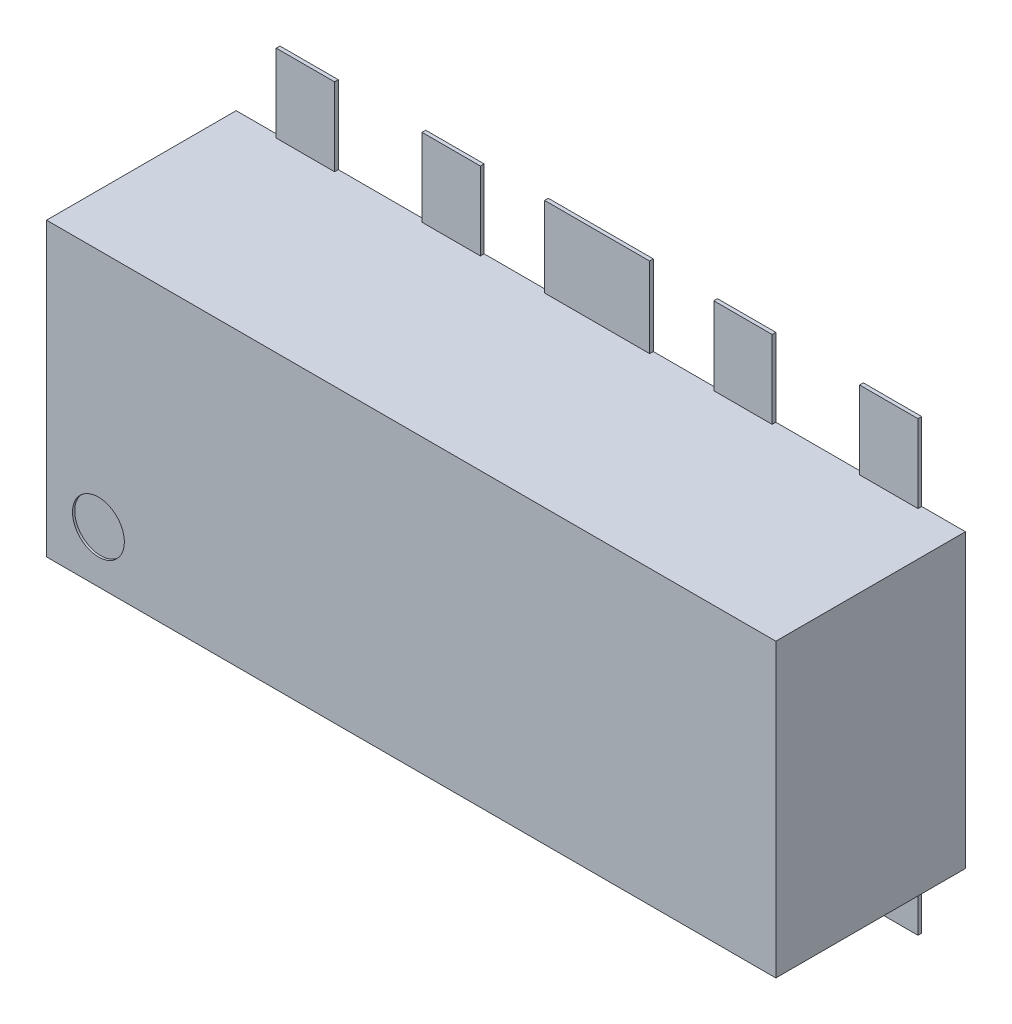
ISO-10303-21;
HEADER;
FILE_DESCRIPTION(('STEP AP214'),'2;1');
FILE_NAME('part.step','',(''),(''),'','','');
FILE_SCHEMA(('AUTOMOTIVE_DESIGN { 1 0 10303 214 1 1 1 1 }'));
ENDSEC;
DATA;
#1=APPLICATION_CONTEXT('core data for automotive mechanical design processes');
#2=APPLICATION_PROTOCOL_DEFINITION('international standard','automotive_design',2000,#1);
#3=PRODUCT_CONTEXT('',#1,'mechanical');
#4=PRODUCT('Part','Part','',(#3));
#5=PRODUCT_RELATED_PRODUCT_CATEGORY('part','',(#4));
#6=PRODUCT_DEFINITION_FORMATION('','',#4);
#7=PRODUCT_DEFINITION_CONTEXT('part definition',#1,'design');
#8=PRODUCT_DEFINITION('design','',#6,#7);
#9=PRODUCT_DEFINITION_SHAPE('','',#8);
#10=(LENGTH_UNIT() NAMED_UNIT(*) SI_UNIT(.MILLI.,.METRE.));
#11=(NAMED_UNIT(*) PLANE_ANGLE_UNIT() SI_UNIT($,.RADIAN.));
#12=(NAMED_UNIT(*) SI_UNIT($,.STERADIAN.) SOLID_ANGLE_UNIT());
#13=UNCERTAINTY_MEASURE_WITH_UNIT(LENGTH_MEASURE(1.E-05),#10,'distance_accuracy_value','');
#14=(GEOMETRIC_REPRESENTATION_CONTEXT(3) GLOBAL_UNCERTAINTY_ASSIGNED_CONTEXT((#13)) GLOBAL_UNIT_ASSIGNED_CONTEXT((#10,
#11,#12)) REPRESENTATION_CONTEXT('',''));
#15=CARTESIAN_POINT('',(0.,0.,0.));
#16=DIRECTION('',(0.,0.,1.));
#17=DIRECTION('',(1.,0.,0.));
#18=AXIS2_PLACEMENT_3D('',#15,#16,#17);
#19=CARTESIAN_POINT('',(0.,0.,0.718566));
#20=DIRECTION('',(0.,0.,1.));
#21=DIRECTION('',(1.,0.,0.));
#22=AXIS2_PLACEMENT_3D('',#19,#20,#21);
#23=PLANE('',#22);
#24=CARTESIAN_POINT('',(-1.07220000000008,-0.322200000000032,0.718566));
#25=DIRECTION('',(0.,0.,1.));
#26=DIRECTION('',(1.,0.,0.));
#27=AXIS2_PLACEMENT_3D('',#24,#25,#26);
#28=CIRCLE('',#27,0.0889);
#29=CARTESIAN_POINT('',(-0.98330000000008,-0.322200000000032,0.718566));
#30=VERTEX_POINT('',#29);
#31=EDGE_CURVE('E19',#30,#30,#28,.T.);
#32=ORIENTED_EDGE('',*,*,#31,.T.);
#33=EDGE_LOOP('',(#32));
#34=FACE_BOUND('',#33,.T.);
#35=ADVANCED_FACE('F16',(#34),#23,.T.);
#36=CARTESIAN_POINT('',(1.25000000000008,0.500000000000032,0.0762));
#37=DIRECTION('',(0.,1.,0.));
#38=DIRECTION('',(0.,0.,1.));
#39=AXIS2_PLACEMENT_3D('',#36,#37,#38);
#40=PLANE('',#39);
#41=DIRECTION('',(0.,0.,1.));
#42=VECTOR('',#41,1.);
#43=CARTESIAN_POINT('',(-0.8999982,0.500000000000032,0.0762));
#44=LINE('',#43,#42);
#45=CARTESIAN_POINT('',(-0.8999982,0.500000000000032,0.0762));
#46=VERTEX_POINT('',#45);
#47=CARTESIAN_POINT('',(-0.8999982,0.500000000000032,0.0889));
#48=VERTEX_POINT('',#47);
#49=EDGE_CURVE('E357',#46,#48,#44,.T.);
#50=ORIENTED_EDGE('',*,*,#49,.T.);
#51=DIRECTION('',(1.,0.,0.));
#52=VECTOR('',#51,1.);
#53=CARTESIAN_POINT('',(0.,0.500000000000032,0.0889));
#54=LINE('',#53,#52);
#55=CARTESIAN_POINT('',(-1.0999978,0.500000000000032,0.0889));
#56=VERTEX_POINT('',#55);
#57=EDGE_CURVE('E300',#56,#48,#54,.T.);
#58=ORIENTED_EDGE('',*,*,#57,.F.);
#59=DIRECTION('',(0.,0.,1.));
#60=VECTOR('',#59,1.);
#61=CARTESIAN_POINT('',(-1.0999978,0.500000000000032,0.0762));
#62=LINE('',#61,#60);
#63=CARTESIAN_POINT('',(-1.0999978,0.500000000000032,0.0762));
#64=VERTEX_POINT('',#63);
#65=EDGE_CURVE('E296',#56,#64,#62,.F.);
#66=ORIENTED_EDGE('',*,*,#65,.T.);
#67=DIRECTION('',(1.,0.,0.));
#68=VECTOR('',#67,1.);
#69=CARTESIAN_POINT('',(1.25000000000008,0.500000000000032,0.0762));
#70=LINE('',#69,#68);
#71=CARTESIAN_POINT('',(-1.25000000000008,0.500000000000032,0.0762));
#72=VERTEX_POINT('',#71);
#73=EDGE_CURVE('E293',#64,#72,#70,.F.);
#74=ORIENTED_EDGE('',*,*,#73,.T.);
#75=DIRECTION('',(0.,0.,1.));
#76=VECTOR('',#75,1.);
#77=CARTESIAN_POINT('',(-1.25000000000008,0.500000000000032,0.0762));
#78=LINE('',#77,#76);
#79=CARTESIAN_POINT('',(-1.25000000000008,0.500000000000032,0.726186));
#80=VERTEX_POINT('',#79);
#81=EDGE_CURVE('E320',#72,#80,#78,.T.);
#82=ORIENTED_EDGE('',*,*,#81,.T.);
#83=DIRECTION('',(1.,0.,0.));
#84=VECTOR('',#83,1.);
#85=CARTESIAN_POINT('',(0.,0.500000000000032,0.726186));
#86=LINE('',#85,#84);
#87=CARTESIAN_POINT('',(1.25000000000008,0.500000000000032,0.726186));
#88=VERTEX_POINT('',#87);
#89=EDGE_CURVE('E328',#88,#80,#86,.F.);
#90=ORIENTED_EDGE('',*,*,#89,.F.);
#91=DIRECTION('',(0.,0.,1.));
#92=VECTOR('',#91,1.);
#93=CARTESIAN_POINT('',(1.25000000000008,0.500000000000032,0.0762));
#94=LINE('',#93,#92);
#95=CARTESIAN_POINT('',(1.25000000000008,0.500000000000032,0.0762));
#96=VERTEX_POINT('',#95);
#97=EDGE_CURVE('E322',#88,#96,#94,.F.);
#98=ORIENTED_EDGE('',*,*,#97,.T.);
#99=DIRECTION('',(1.,0.,0.));
#100=VECTOR('',#99,1.);
#101=CARTESIAN_POINT('',(1.25000000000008,0.500000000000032,0.0762));
#102=LINE('',#101,#100);
#103=CARTESIAN_POINT('',(1.0999978,0.500000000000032,0.0762));
#104=VERTEX_POINT('',#103);
#105=EDGE_CURVE('E383',#96,#104,#102,.F.);
#106=ORIENTED_EDGE('',*,*,#105,.T.);
#107=DIRECTION('',(0.,0.,1.));
#108=VECTOR('',#107,1.);
#109=CARTESIAN_POINT('',(1.0999978,0.500000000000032,0.0762));
#110=LINE('',#109,#108);
#111=CARTESIAN_POINT('',(1.0999978,0.500000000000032,0.0889));
#112=VERTEX_POINT('',#111);
#113=EDGE_CURVE('E381',#104,#112,#110,.T.);
#114=ORIENTED_EDGE('',*,*,#113,.T.);
#115=DIRECTION('',(1.,0.,0.));
#116=VECTOR('',#115,1.);
#117=CARTESIAN_POINT('',(0.,0.500000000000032,0.0889));
#118=LINE('',#117,#116);
#119=CARTESIAN_POINT('',(0.8999982,0.500000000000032,0.0889));
#120=VERTEX_POINT('',#119);
#121=EDGE_CURVE('E354',#120,#112,#118,.T.);
#122=ORIENTED_EDGE('',*,*,#121,.F.);
#123=DIRECTION('',(0.,0.,1.));
#124=VECTOR('',#123,1.);
#125=CARTESIAN_POINT('',(0.8999982,0.500000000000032,0.0762));
#126=LINE('',#125,#124);
#127=CARTESIAN_POINT('',(0.8999982,0.500000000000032,0.0762));
#128=VERTEX_POINT('',#127);
#129=EDGE_CURVE('E379',#120,#128,#126,.F.);
#130=ORIENTED_EDGE('',*,*,#129,.T.);
#131=DIRECTION('',(1.,0.,0.));
#132=VECTOR('',#131,1.);
#133=CARTESIAN_POINT('',(1.25000000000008,0.500000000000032,0.0762));
#134=LINE('',#133,#132);
#135=CARTESIAN_POINT('',(0.5999988,0.500000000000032,0.0762));
#136=VERTEX_POINT('',#135);
#137=EDGE_CURVE('E377',#128,#136,#134,.F.);
#138=ORIENTED_EDGE('',*,*,#137,.T.);
#139=DIRECTION('',(0.,0.,1.));
#140=VECTOR('',#139,1.);
#141=CARTESIAN_POINT('',(0.5999988,0.500000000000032,0.0762));
#142=LINE('',#141,#140);
#143=CARTESIAN_POINT('',(0.5999988,0.500000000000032,0.0889));
#144=VERTEX_POINT('',#143);
#145=EDGE_CURVE('E375',#136,#144,#142,.T.);
#146=ORIENTED_EDGE('',*,*,#145,.T.);
#147=DIRECTION('',(1.,0.,0.));
#148=VECTOR('',#147,1.);
#149=CARTESIAN_POINT('',(0.,0.500000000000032,0.0889));
#150=LINE('',#149,#148);
#151=CARTESIAN_POINT('',(0.3999992,0.500000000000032,0.0889));
#152=VERTEX_POINT('',#151);
#153=EDGE_CURVE('E351',#152,#144,#150,.T.);
#154=ORIENTED_EDGE('',*,*,#153,.F.);
#155=DIRECTION('',(0.,0.,1.));
#156=VECTOR('',#155,1.);
#157=CARTESIAN_POINT('',(0.3999992,0.500000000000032,0.0762));
#158=LINE('',#157,#156);
#159=CARTESIAN_POINT('',(0.3999992,0.500000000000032,0.0762));
#160=VERTEX_POINT('',#159);
#161=EDGE_CURVE('E373',#152,#160,#158,.F.);
#162=ORIENTED_EDGE('',*,*,#161,.T.);
#163=DIRECTION('',(1.,0.,0.));
#164=VECTOR('',#163,1.);
#165=CARTESIAN_POINT('',(1.25000000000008,0.500000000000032,0.0762));
#166=LINE('',#165,#164);
#167=CARTESIAN_POINT('',(0.1800098,0.500000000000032,0.0762));
#168=VERTEX_POINT('',#167);
#169=EDGE_CURVE('E371',#160,#168,#166,.F.);
#170=ORIENTED_EDGE('',*,*,#169,.T.);
#171=DIRECTION('',(0.,0.,1.));
#172=VECTOR('',#171,1.);
#173=CARTESIAN_POINT('',(0.1800098,0.500000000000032,0.0762));
#174=LINE('',#173,#172);
#175=CARTESIAN_POINT('',(0.1800098,0.500000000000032,0.0889));
#176=VERTEX_POINT('',#175);
#177=EDGE_CURVE('E369',#168,#176,#174,.T.);
#178=ORIENTED_EDGE('',*,*,#177,.T.);
#179=DIRECTION('',(1.,0.,0.));
#180=VECTOR('',#179,1.);
#181=CARTESIAN_POINT('',(0.,0.500000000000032,0.0889));
#182=LINE('',#181,#180);
#183=CARTESIAN_POINT('',(-0.1800098,0.500000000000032,0.0889));
#184=VERTEX_POINT('',#183);
#185=EDGE_CURVE('E348',#184,#176,#182,.T.);
#186=ORIENTED_EDGE('',*,*,#185,.F.);
#187=DIRECTION('',(0.,0.,1.));
#188=VECTOR('',#187,1.);
#189=CARTESIAN_POINT('',(-0.1800098,0.500000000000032,0.0762));
#190=LINE('',#189,#188);
#191=CARTESIAN_POINT('',(-0.1800098,0.500000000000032,0.0762));
#192=VERTEX_POINT('',#191);
#193=EDGE_CURVE('E367',#184,#192,#190,.F.);
#194=ORIENTED_EDGE('',*,*,#193,.T.);
#195=DIRECTION('',(1.,0.,0.));
#196=VECTOR('',#195,1.);
#197=CARTESIAN_POINT('',(1.25000000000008,0.500000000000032,0.0762));
#198=LINE('',#197,#196);
#199=CARTESIAN_POINT('',(-0.3999992,0.500000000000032,0.0762));
#200=VERTEX_POINT('',#199);
#201=EDGE_CURVE('E365',#192,#200,#198,.F.);
#202=ORIENTED_EDGE('',*,*,#201,.T.);
#203=DIRECTION('',(0.,0.,1.));
#204=VECTOR('',#203,1.);
#205=CARTESIAN_POINT('',(-0.3999992,0.500000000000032,0.0762));
#206=LINE('',#205,#204);
#207=CARTESIAN_POINT('',(-0.3999992,0.500000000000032,0.0889));
#208=VERTEX_POINT('',#207);
#209=EDGE_CURVE('E363',#200,#208,#206,.T.);
#210=ORIENTED_EDGE('',*,*,#209,.T.);
#211=DIRECTION('',(1.,0.,0.));
#212=VECTOR('',#211,1.);
#213=CARTESIAN_POINT('',(0.,0.500000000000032,0.0889));
#214=LINE('',#213,#212);
#215=CARTESIAN_POINT('',(-0.5999988,0.500000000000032,0.0889));
#216=VERTEX_POINT('',#215);
#217=EDGE_CURVE('E345',#216,#208,#214,.T.);
#218=ORIENTED_EDGE('',*,*,#217,.F.);
#219=DIRECTION('',(0.,0.,1.));
#220=VECTOR('',#219,1.);
#221=CARTESIAN_POINT('',(-0.5999988,0.500000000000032,0.0762));
#222=LINE('',#221,#220);
#223=CARTESIAN_POINT('',(-0.5999988,0.500000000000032,0.0762));
#224=VERTEX_POINT('',#223);
#225=EDGE_CURVE('E361',#216,#224,#222,.F.);
#226=ORIENTED_EDGE('',*,*,#225,.T.);
#227=DIRECTION('',(1.,0.,0.));
#228=VECTOR('',#227,1.);
#229=CARTESIAN_POINT('',(1.25000000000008,0.500000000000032,0.0762));
#230=LINE('',#229,#228);
#231=EDGE_CURVE('E359',#224,#46,#230,.F.);
#232=ORIENTED_EDGE('',*,*,#231,.T.);
#233=EDGE_LOOP('',(#50,#58,#66,#74,#82,#90,#98,#106,#114,#122,#130,#138,#146,#154,#162,#170,
#178,#186,#194,#202,#210,#218,#226,#232));
#234=FACE_BOUND('',#233,.T.);
#235=ADVANCED_FACE('F298',(#234),#40,.T.);
#236=CARTESIAN_POINT('',(-1.07220000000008,-0.322200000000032,0.726186));
#237=DIRECTION('',(0.,0.,1.));
#238=DIRECTION('',(1.,0.,0.));
#239=AXIS2_PLACEMENT_3D('',#236,#237,#238);
#240=CYLINDRICAL_SURFACE('',#239,0.0889);
#241=ORIENTED_EDGE('',*,*,#31,.F.);
#242=EDGE_LOOP('',(#241));
#243=FACE_BOUND('',#242,.T.);
#244=CARTESIAN_POINT('',(-1.07220000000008,-0.322200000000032,0.726186));
#245=DIRECTION('',(0.,0.,1.));
#246=DIRECTION('',(1.,0.,0.));
#247=AXIS2_PLACEMENT_3D('',#244,#245,#246);
#248=CIRCLE('',#247,0.0889);
#249=CARTESIAN_POINT('',(-0.98330000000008,-0.322200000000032,0.726186));
#250=VERTEX_POINT('',#249);
#251=EDGE_CURVE('E325',#250,#250,#248,.F.);
#252=ORIENTED_EDGE('',*,*,#251,.F.);
#253=EDGE_LOOP('',(#252));
#254=FACE_BOUND('',#253,.T.);
#255=ADVANCED_FACE('F892',(#243,#254),#240,.F.);
#256=CARTESIAN_POINT('',(0.,0.,0.0889));
#257=DIRECTION('',(0.,0.,1.));
#258=DIRECTION('',(1.,0.,0.));
#259=AXIS2_PLACEMENT_3D('',#256,#257,#258);
#260=PLANE('',#259);
#261=DIRECTION('',(0.,1.,0.));
#262=VECTOR('',#261,1.);
#263=CARTESIAN_POINT('',(0.8999982,0.7670038,0.0889));
#264=LINE('',#263,#262);
#265=CARTESIAN_POINT('',(0.8999982,0.7670038,0.0889));
#266=VERTEX_POINT('',#265);
#267=EDGE_CURVE('E406',#120,#266,#264,.T.);
#268=ORIENTED_EDGE('',*,*,#267,.F.);
#269=ORIENTED_EDGE('',*,*,#121,.T.);
#270=DIRECTION('',(0.,1.,0.));
#271=VECTOR('',#270,1.);
#272=CARTESIAN_POINT('',(1.0999978,0.1070102,0.0889));
#273=LINE('',#272,#271);
#274=CARTESIAN_POINT('',(1.0999978,0.7670038,0.0889));
#275=VERTEX_POINT('',#274);
#276=EDGE_CURVE('E327',#275,#112,#273,.F.);
#277=ORIENTED_EDGE('',*,*,#276,.F.);
#278=DIRECTION('',(1.,0.,0.));
#279=VECTOR('',#278,1.);
#280=CARTESIAN_POINT('',(1.0999978,0.7670038,0.0889));
#281=LINE('',#280,#279);
#282=EDGE_CURVE('E332',#266,#275,#281,.T.);
#283=ORIENTED_EDGE('',*,*,#282,.F.);
#284=EDGE_LOOP('',(#268,#269,#277,#283));
#285=FACE_BOUND('',#284,.T.);
#286=ADVANCED_FACE('F404',(#285),#260,.T.);
#287=CARTESIAN_POINT('',(0.,0.,0.0889));
#288=DIRECTION('',(0.,0.,1.));
#289=DIRECTION('',(1.,0.,0.));
#290=AXIS2_PLACEMENT_3D('',#287,#288,#289);
#291=PLANE('',#290);
#292=DIRECTION('',(0.,1.,0.));
#293=VECTOR('',#292,1.);
#294=CARTESIAN_POINT('',(0.3999992,0.7670038,0.0889));
#295=LINE('',#294,#293);
#296=CARTESIAN_POINT('',(0.3999992,0.7670038,0.0889));
#297=VERTEX_POINT('',#296);
#298=EDGE_CURVE('E558',#152,#297,#295,.T.);
#299=ORIENTED_EDGE('',*,*,#298,.F.);
#300=ORIENTED_EDGE('',*,*,#153,.T.);
#301=DIRECTION('',(0.,1.,0.));
#302=VECTOR('',#301,1.);
#303=CARTESIAN_POINT('',(0.5999988,0.1070102,0.0889));
#304=LINE('',#303,#302);
#305=CARTESIAN_POINT('',(0.5999988,0.7670038,0.0889));
#306=VERTEX_POINT('',#305);
#307=EDGE_CURVE('E412',#306,#144,#304,.F.);
#308=ORIENTED_EDGE('',*,*,#307,.F.);
#309=DIRECTION('',(1.,0.,0.));
#310=VECTOR('',#309,1.);
#311=CARTESIAN_POINT('',(0.5999988,0.7670038,0.0889));
#312=LINE('',#311,#310);
#313=EDGE_CURVE('E562',#297,#306,#312,.T.);
#314=ORIENTED_EDGE('',*,*,#313,.F.);
#315=EDGE_LOOP('',(#299,#300,#308,#314));
#316=FACE_BOUND('',#315,.T.);
#317=ADVANCED_FACE('F572',(#316),#291,.T.);
#318=CARTESIAN_POINT('',(0.,0.,0.0889));
#319=DIRECTION('',(0.,0.,1.));
#320=DIRECTION('',(1.,0.,0.));
#321=AXIS2_PLACEMENT_3D('',#318,#319,#320);
#322=PLANE('',#321);
#323=DIRECTION('',(0.,1.,0.));
#324=VECTOR('',#323,1.);
#325=CARTESIAN_POINT('',(-0.1800098,0.7750048,0.0889));
#326=LINE('',#325,#324);
#327=CARTESIAN_POINT('',(-0.1800098,0.7750048,0.0889));
#328=VERTEX_POINT('',#327);
#329=EDGE_CURVE('E547',#184,#328,#326,.T.);
#330=ORIENTED_EDGE('',*,*,#329,.F.);
#331=ORIENTED_EDGE('',*,*,#185,.T.);
#332=DIRECTION('',(0.,1.,0.));
#333=VECTOR('',#332,1.);
#334=CARTESIAN_POINT('',(0.1800098,-0.7750048,0.0889));
#335=LINE('',#334,#333);
#336=CARTESIAN_POINT('',(0.1800098,0.7750048,0.0889));
#337=VERTEX_POINT('',#336);
#338=EDGE_CURVE('E553',#337,#176,#335,.F.);
#339=ORIENTED_EDGE('',*,*,#338,.F.);
#340=DIRECTION('',(1.,0.,0.));
#341=VECTOR('',#340,1.);
#342=CARTESIAN_POINT('',(0.1800098,0.7750048,0.0889));
#343=LINE('',#342,#341);
#344=EDGE_CURVE('E551',#328,#337,#343,.T.);
#345=ORIENTED_EDGE('',*,*,#344,.F.);
#346=EDGE_LOOP('',(#330,#331,#339,#345));
#347=FACE_BOUND('',#346,.T.);
#348=ADVANCED_FACE('F883',(#347),#322,.T.);
#349=CARTESIAN_POINT('',(0.,0.,0.0889));
#350=DIRECTION('',(0.,0.,1.));
#351=DIRECTION('',(1.,0.,0.));
#352=AXIS2_PLACEMENT_3D('',#349,#350,#351);
#353=PLANE('',#352);
#354=DIRECTION('',(0.,1.,0.));
#355=VECTOR('',#354,1.);
#356=CARTESIAN_POINT('',(-0.5999988,0.7670038,0.0889));
#357=LINE('',#356,#355);
#358=CARTESIAN_POINT('',(-0.5999988,0.7670038,0.0889));
#359=VERTEX_POINT('',#358);
#360=EDGE_CURVE('E536',#216,#359,#357,.T.);
#361=ORIENTED_EDGE('',*,*,#360,.F.);
#362=ORIENTED_EDGE('',*,*,#217,.T.);
#363=DIRECTION('',(0.,1.,0.));
#364=VECTOR('',#363,1.);
#365=CARTESIAN_POINT('',(-0.3999992,0.1070102,0.0889));
#366=LINE('',#365,#364);
#367=CARTESIAN_POINT('',(-0.3999992,0.7670038,0.0889));
#368=VERTEX_POINT('',#367);
#369=EDGE_CURVE('E542',#368,#208,#366,.F.);
#370=ORIENTED_EDGE('',*,*,#369,.F.);
#371=DIRECTION('',(1.,0.,0.));
#372=VECTOR('',#371,1.);
#373=CARTESIAN_POINT('',(-0.3999992,0.7670038,0.0889));
#374=LINE('',#373,#372);
#375=EDGE_CURVE('E540',#359,#368,#374,.T.);
#376=ORIENTED_EDGE('',*,*,#375,.F.);
#377=EDGE_LOOP('',(#361,#362,#370,#376));
#378=FACE_BOUND('',#377,.T.);
#379=ADVANCED_FACE('F879',(#378),#353,.T.);
#380=CARTESIAN_POINT('',(0.,0.,0.0889));
#381=DIRECTION('',(0.,0.,1.));
#382=DIRECTION('',(1.,0.,0.));
#383=AXIS2_PLACEMENT_3D('',#380,#381,#382);
#384=PLANE('',#383);
#385=DIRECTION('',(0.,1.,0.));
#386=VECTOR('',#385,1.);
#387=CARTESIAN_POINT('',(-1.0999978,0.7670038,0.0889));
#388=LINE('',#387,#386);
#389=CARTESIAN_POINT('',(-1.0999978,0.7670038,0.0889));
#390=VERTEX_POINT('',#389);
#391=EDGE_CURVE('E525',#56,#390,#388,.T.);
#392=ORIENTED_EDGE('',*,*,#391,.F.);
#393=ORIENTED_EDGE('',*,*,#57,.T.);
#394=DIRECTION('',(0.,1.,0.));
#395=VECTOR('',#394,1.);
#396=CARTESIAN_POINT('',(-0.8999982,0.1070102,0.0889));
#397=LINE('',#396,#395);
#398=CARTESIAN_POINT('',(-0.8999982,0.7670038,0.0889));
#399=VERTEX_POINT('',#398);
#400=EDGE_CURVE('E531',#399,#48,#397,.F.);
#401=ORIENTED_EDGE('',*,*,#400,.F.);
#402=DIRECTION('',(1.,0.,0.));
#403=VECTOR('',#402,1.);
#404=CARTESIAN_POINT('',(-0.8999982,0.7670038,0.0889));
#405=LINE('',#404,#403);
#406=EDGE_CURVE('E529',#390,#399,#405,.T.);
#407=ORIENTED_EDGE('',*,*,#406,.F.);
#408=EDGE_LOOP('',(#392,#393,#401,#407));
#409=FACE_BOUND('',#408,.T.);
#410=ADVANCED_FACE('F874',(#409),#384,.T.);
#411=CARTESIAN_POINT('',(0.,0.,0.0889));
#412=DIRECTION('',(0.,0.,1.));
#413=DIRECTION('',(1.,0.,0.));
#414=AXIS2_PLACEMENT_3D('',#411,#412,#413);
#415=PLANE('',#414);
#416=DIRECTION('',(0.,1.,0.));
#417=VECTOR('',#416,1.);
#418=CARTESIAN_POINT('',(-0.3999992,-0.7670038,0.0889));
#419=LINE('',#418,#417);
#420=CARTESIAN_POINT('',(-0.3999992,-0.500000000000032,0.0889));
#421=VERTEX_POINT('',#420);
#422=CARTESIAN_POINT('',(-0.3999992,-0.7670038,0.0889));
#423=VERTEX_POINT('',#422);
#424=EDGE_CURVE('E504',#421,#423,#419,.F.);
#425=ORIENTED_EDGE('',*,*,#424,.F.);
#426=DIRECTION('',(1.,0.,0.));
#427=VECTOR('',#426,1.);
#428=CARTESIAN_POINT('',(-1.25000000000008,-0.500000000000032,0.0889));
#429=LINE('',#428,#427);
#430=CARTESIAN_POINT('',(-0.5999988,-0.500000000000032,0.0889));
#431=VERTEX_POINT('',#430);
#432=EDGE_CURVE('E465',#431,#421,#429,.T.);
#433=ORIENTED_EDGE('',*,*,#432,.F.);
#434=DIRECTION('',(0.,1.,0.));
#435=VECTOR('',#434,1.);
#436=CARTESIAN_POINT('',(-0.5999988,-0.1070102,0.0889));
#437=LINE('',#436,#435);
#438=CARTESIAN_POINT('',(-0.5999988,-0.7670038,0.0889));
#439=VERTEX_POINT('',#438);
#440=EDGE_CURVE('E510',#439,#431,#437,.T.);
#441=ORIENTED_EDGE('',*,*,#440,.F.);
#442=DIRECTION('',(1.,0.,0.));
#443=VECTOR('',#442,1.);
#444=CARTESIAN_POINT('',(-0.5999988,-0.7670038,0.0889));
#445=LINE('',#444,#443);
#446=EDGE_CURVE('E508',#423,#439,#445,.F.);
#447=ORIENTED_EDGE('',*,*,#446,.F.);
#448=EDGE_LOOP('',(#425,#433,#441,#447));
#449=FACE_BOUND('',#448,.T.);
#450=ADVANCED_FACE('F840',(#449),#415,.T.);
#451=CARTESIAN_POINT('',(0.,0.,0.0889));
#452=DIRECTION('',(0.,0.,1.));
#453=DIRECTION('',(1.,0.,0.));
#454=AXIS2_PLACEMENT_3D('',#451,#452,#453);
#455=PLANE('',#454);
#456=DIRECTION('',(0.,1.,0.));
#457=VECTOR('',#456,1.);
#458=CARTESIAN_POINT('',(0.1800098,-0.7750048,0.0889));
#459=LINE('',#458,#457);
#460=CARTESIAN_POINT('',(0.1800098,-0.500000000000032,0.0889));
#461=VERTEX_POINT('',#460);
#462=CARTESIAN_POINT('',(0.1800098,-0.7750048,0.0889));
#463=VERTEX_POINT('',#462);
#464=EDGE_CURVE('E494',#461,#463,#459,.F.);
#465=ORIENTED_EDGE('',*,*,#464,.F.);
#466=DIRECTION('',(1.,0.,0.));
#467=VECTOR('',#466,1.);
#468=CARTESIAN_POINT('',(-1.25000000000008,-0.500000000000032,0.0889));
#469=LINE('',#468,#467);
#470=CARTESIAN_POINT('',(-0.1800098,-0.500000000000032,0.0889));
#471=VERTEX_POINT('',#470);
#472=EDGE_CURVE('E458',#471,#461,#469,.T.);
#473=ORIENTED_EDGE('',*,*,#472,.F.);
#474=DIRECTION('',(0.,1.,0.));
#475=VECTOR('',#474,1.);
#476=CARTESIAN_POINT('',(-0.1800098,0.7750048,0.0889));
#477=LINE('',#476,#475);
#478=CARTESIAN_POINT('',(-0.1800098,-0.7750048,0.0889));
#479=VERTEX_POINT('',#478);
#480=EDGE_CURVE('E500',#479,#471,#477,.T.);
#481=ORIENTED_EDGE('',*,*,#480,.F.);
#482=DIRECTION('',(1.,0.,0.));
#483=VECTOR('',#482,1.);
#484=CARTESIAN_POINT('',(-0.1800098,-0.7750048,0.0889));
#485=LINE('',#484,#483);
#486=EDGE_CURVE('E498',#463,#479,#485,.F.);
#487=ORIENTED_EDGE('',*,*,#486,.F.);
#488=EDGE_LOOP('',(#465,#473,#481,#487));
#489=FACE_BOUND('',#488,.T.);
#490=ADVANCED_FACE('F699',(#489),#455,.T.);
#491=CARTESIAN_POINT('',(0.,0.,0.0889));
#492=DIRECTION('',(0.,0.,1.));
#493=DIRECTION('',(1.,0.,0.));
#494=AXIS2_PLACEMENT_3D('',#491,#492,#493);
#495=PLANE('',#494);
#496=DIRECTION('',(0.,1.,0.));
#497=VECTOR('',#496,1.);
#498=CARTESIAN_POINT('',(0.5999988,-0.7670038,0.0889));
#499=LINE('',#498,#497);
#500=CARTESIAN_POINT('',(0.5999988,-0.500000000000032,0.0889));
#501=VERTEX_POINT('',#500);
#502=CARTESIAN_POINT('',(0.5999988,-0.7670038,0.0889));
#503=VERTEX_POINT('',#502);
#504=EDGE_CURVE('E484',#501,#503,#499,.F.);
#505=ORIENTED_EDGE('',*,*,#504,.F.);
#506=DIRECTION('',(1.,0.,0.));
#507=VECTOR('',#506,1.);
#508=CARTESIAN_POINT('',(-1.25000000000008,-0.500000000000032,0.0889));
#509=LINE('',#508,#507);
#510=CARTESIAN_POINT('',(0.3999992,-0.500000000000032,0.0889));
#511=VERTEX_POINT('',#510);
#512=EDGE_CURVE('E451',#511,#501,#509,.T.);
#513=ORIENTED_EDGE('',*,*,#512,.F.);
#514=DIRECTION('',(0.,1.,0.));
#515=VECTOR('',#514,1.);
#516=CARTESIAN_POINT('',(0.3999992,-0.1070102,0.0889));
#517=LINE('',#516,#515);
#518=CARTESIAN_POINT('',(0.3999992,-0.7670038,0.0889));
#519=VERTEX_POINT('',#518);
#520=EDGE_CURVE('E490',#519,#511,#517,.T.);
#521=ORIENTED_EDGE('',*,*,#520,.F.);
#522=DIRECTION('',(1.,0.,0.));
#523=VECTOR('',#522,1.);
#524=CARTESIAN_POINT('',(0.3999992,-0.7670038,0.0889));
#525=LINE('',#524,#523);
#526=EDGE_CURVE('E488',#503,#519,#525,.F.);
#527=ORIENTED_EDGE('',*,*,#526,.F.);
#528=EDGE_LOOP('',(#505,#513,#521,#527));
#529=FACE_BOUND('',#528,.T.);
#530=ADVANCED_FACE('F690',(#529),#495,.T.);
#531=CARTESIAN_POINT('',(0.,0.,0.0889));
#532=DIRECTION('',(0.,0.,1.));
#533=DIRECTION('',(1.,0.,0.));
#534=AXIS2_PLACEMENT_3D('',#531,#532,#533);
#535=PLANE('',#534);
#536=DIRECTION('',(0.,1.,0.));
#537=VECTOR('',#536,1.);
#538=CARTESIAN_POINT('',(1.0999978,-0.7670038,0.0889));
#539=LINE('',#538,#537);
#540=CARTESIAN_POINT('',(1.0999978,-0.500000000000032,0.0889));
#541=VERTEX_POINT('',#540);
#542=CARTESIAN_POINT('',(1.0999978,-0.7670038,0.0889));
#543=VERTEX_POINT('',#542);
#544=EDGE_CURVE('E474',#541,#543,#539,.F.);
#545=ORIENTED_EDGE('',*,*,#544,.F.);
#546=DIRECTION('',(1.,0.,0.));
#547=VECTOR('',#546,1.);
#548=CARTESIAN_POINT('',(-1.25000000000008,-0.500000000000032,0.0889));
#549=LINE('',#548,#547);
#550=CARTESIAN_POINT('',(0.8999982,-0.500000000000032,0.0889));
#551=VERTEX_POINT('',#550);
#552=EDGE_CURVE('E444',#551,#541,#549,.T.);
#553=ORIENTED_EDGE('',*,*,#552,.F.);
#554=DIRECTION('',(0.,1.,0.));
#555=VECTOR('',#554,1.);
#556=CARTESIAN_POINT('',(0.8999982,-0.1070102,0.0889));
#557=LINE('',#556,#555);
#558=CARTESIAN_POINT('',(0.8999982,-0.7670038,0.0889));
#559=VERTEX_POINT('',#558);
#560=EDGE_CURVE('E480',#559,#551,#557,.T.);
#561=ORIENTED_EDGE('',*,*,#560,.F.);
#562=DIRECTION('',(1.,0.,0.));
#563=VECTOR('',#562,1.);
#564=CARTESIAN_POINT('',(0.8999982,-0.7670038,0.0889));
#565=LINE('',#564,#563);
#566=EDGE_CURVE('E478',#543,#559,#565,.F.);
#567=ORIENTED_EDGE('',*,*,#566,.F.);
#568=EDGE_LOOP('',(#545,#553,#561,#567));
#569=FACE_BOUND('',#568,.T.);
#570=ADVANCED_FACE('F687',(#569),#535,.T.);
#571=CARTESIAN_POINT('',(0.,0.,0.726186));
#572=DIRECTION('',(0.,0.,1.));
#573=DIRECTION('',(1.,0.,0.));
#574=AXIS2_PLACEMENT_3D('',#571,#572,#573);
#575=PLANE('',#574);
#576=ORIENTED_EDGE('',*,*,#251,.T.);
#577=EDGE_LOOP('',(#576));
#578=FACE_BOUND('',#577,.T.);
#579=ORIENTED_EDGE('',*,*,#89,.T.);
#580=DIRECTION('',(0.,1.,0.));
#581=VECTOR('',#580,1.);
#582=CARTESIAN_POINT('',(-1.25000000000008,0.500000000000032,0.726186));
#583=LINE('',#582,#581);
#584=CARTESIAN_POINT('',(-1.25000000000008,-0.500000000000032,0.726186));
#585=VERTEX_POINT('',#584);
#586=EDGE_CURVE('E522',#585,#80,#583,.T.);
#587=ORIENTED_EDGE('',*,*,#586,.F.);
#588=DIRECTION('',(1.,0.,0.));
#589=VECTOR('',#588,1.);
#590=CARTESIAN_POINT('',(-1.25000000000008,-0.500000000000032,0.726186));
#591=LINE('',#590,#589);
#592=CARTESIAN_POINT('',(1.25000000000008,-0.500000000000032,0.726186));
#593=VERTEX_POINT('',#592);
#594=EDGE_CURVE('E440',#593,#585,#591,.F.);
#595=ORIENTED_EDGE('',*,*,#594,.F.);
#596=DIRECTION('',(0.,1.,0.));
#597=VECTOR('',#596,1.);
#598=CARTESIAN_POINT('',(1.25000000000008,0.,0.726186));
#599=LINE('',#598,#597);
#600=EDGE_CURVE('E335',#593,#88,#599,.T.);
#601=ORIENTED_EDGE('',*,*,#600,.T.);
#602=EDGE_LOOP('',(#579,#587,#595,#601));
#603=FACE_BOUND('',#602,.T.);
#604=ADVANCED_FACE('F689',(#578,#603),#575,.T.);
#605=CARTESIAN_POINT('',(0.,0.,0.0889));
#606=DIRECTION('',(0.,0.,1.));
#607=DIRECTION('',(1.,0.,0.));
#608=AXIS2_PLACEMENT_3D('',#605,#606,#607);
#609=PLANE('',#608);
#610=DIRECTION('',(0.,1.,0.));
#611=VECTOR('',#610,1.);
#612=CARTESIAN_POINT('',(-0.8999982,-0.7670038,0.0889));
#613=LINE('',#612,#611);
#614=CARTESIAN_POINT('',(-0.8999982,-0.500000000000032,0.0889));
#615=VERTEX_POINT('',#614);
#616=CARTESIAN_POINT('',(-0.8999982,-0.7670038,0.0889));
#617=VERTEX_POINT('',#616);
#618=EDGE_CURVE('E514',#615,#617,#613,.F.);
#619=ORIENTED_EDGE('',*,*,#618,.F.);
#620=DIRECTION('',(1.,0.,0.));
#621=VECTOR('',#620,1.);
#622=CARTESIAN_POINT('',(-1.25000000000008,-0.500000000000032,0.0889));
#623=LINE('',#622,#621);
#624=CARTESIAN_POINT('',(-1.0999978,-0.500000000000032,0.0889));
#625=VERTEX_POINT('',#624);
#626=EDGE_CURVE('E432',#625,#615,#623,.T.);
#627=ORIENTED_EDGE('',*,*,#626,.F.);
#628=DIRECTION('',(0.,1.,0.));
#629=VECTOR('',#628,1.);
#630=CARTESIAN_POINT('',(-1.0999978,-0.1070102,0.0889));
#631=LINE('',#630,#629);
#632=CARTESIAN_POINT('',(-1.0999978,-0.7670038,0.0889));
#633=VERTEX_POINT('',#632);
#634=EDGE_CURVE('E520',#633,#625,#631,.T.);
#635=ORIENTED_EDGE('',*,*,#634,.F.);
#636=DIRECTION('',(1.,0.,0.));
#637=VECTOR('',#636,1.);
#638=CARTESIAN_POINT('',(-1.0999978,-0.7670038,0.0889));
#639=LINE('',#638,#637);
#640=EDGE_CURVE('E518',#617,#633,#639,.F.);
#641=ORIENTED_EDGE('',*,*,#640,.F.);
#642=EDGE_LOOP('',(#619,#627,#635,#641));
#643=FACE_BOUND('',#642,.T.);
#644=ADVANCED_FACE('F697',(#643),#609,.T.);
#645=CARTESIAN_POINT('',(1.0999978,0.1070102,0.0762));
#646=DIRECTION('',(1.,0.,0.));
#647=DIRECTION('',(0.,0.,-1.));
#648=AXIS2_PLACEMENT_3D('',#645,#646,#647);
#649=PLANE('',#648);
#650=ORIENTED_EDGE('',*,*,#276,.T.);
#651=ORIENTED_EDGE('',*,*,#113,.F.);
#652=DIRECTION('',(0.,1.,0.));
#653=VECTOR('',#652,1.);
#654=CARTESIAN_POINT('',(1.0999978,0.,0.0762));
#655=LINE('',#654,#653);
#656=CARTESIAN_POINT('',(1.0999978,0.7670038,0.0762));
#657=VERTEX_POINT('',#656);
#658=EDGE_CURVE('E391',#104,#657,#655,.T.);
#659=ORIENTED_EDGE('',*,*,#658,.T.);
#660=DIRECTION('',(0.,0.,1.));
#661=VECTOR('',#660,1.);
#662=CARTESIAN_POINT('',(1.0999978,0.7670038,0.0762));
#663=LINE('',#662,#661);
#664=EDGE_CURVE('E410',#275,#657,#663,.F.);
#665=ORIENTED_EDGE('',*,*,#664,.F.);
#666=EDGE_LOOP('',(#650,#651,#659,#665));
#667=FACE_BOUND('',#666,.T.);
#668=ADVANCED_FACE('F399',(#667),#649,.T.);
#669=CARTESIAN_POINT('',(1.0999978,0.7670038,0.0762));
#670=DIRECTION('',(0.,1.,0.));
#671=DIRECTION('',(0.,0.,1.));
#672=AXIS2_PLACEMENT_3D('',#669,#670,#671);
#673=PLANE('',#672);
#674=ORIENTED_EDGE('',*,*,#664,.T.);
#675=DIRECTION('',(1.,0.,0.));
#676=VECTOR('',#675,1.);
#677=CARTESIAN_POINT('',(0.,0.7670038,0.0762));
#678=LINE('',#677,#676);
#679=CARTESIAN_POINT('',(0.8999982,0.7670038,0.0762));
#680=VERTEX_POINT('',#679);
#681=EDGE_CURVE('E395',#657,#680,#678,.F.);
#682=ORIENTED_EDGE('',*,*,#681,.T.);
#683=DIRECTION('',(0.,0.,1.));
#684=VECTOR('',#683,1.);
#685=CARTESIAN_POINT('',(0.8999982,0.7670038,0.0762));
#686=LINE('',#685,#684);
#687=EDGE_CURVE('E409',#266,#680,#686,.F.);
#688=ORIENTED_EDGE('',*,*,#687,.F.);
#689=ORIENTED_EDGE('',*,*,#282,.T.);
#690=EDGE_LOOP('',(#674,#682,#688,#689));
#691=FACE_BOUND('',#690,.T.);
#692=ADVANCED_FACE('F417',(#691),#673,.T.);
#693=CARTESIAN_POINT('',(0.8999982,0.7670038,0.0762));
#694=DIRECTION('',(-1.,0.,0.));
#695=DIRECTION('',(0.,0.,1.));
#696=AXIS2_PLACEMENT_3D('',#693,#694,#695);
#697=PLANE('',#696);
#698=DIRECTION('',(0.,1.,0.));
#699=VECTOR('',#698,1.);
#700=CARTESIAN_POINT('',(0.8999982,0.,0.0762));
#701=LINE('',#700,#699);
#702=EDGE_CURVE('E420',#680,#128,#701,.F.);
#703=ORIENTED_EDGE('',*,*,#702,.T.);
#704=ORIENTED_EDGE('',*,*,#129,.F.);
#705=ORIENTED_EDGE('',*,*,#267,.T.);
#706=ORIENTED_EDGE('',*,*,#687,.T.);
#707=EDGE_LOOP('',(#703,#704,#705,#706));
#708=FACE_BOUND('',#707,.T.);
#709=ADVANCED_FACE('F419',(#708),#697,.T.);
#710=CARTESIAN_POINT('',(0.5999988,0.1070102,0.0762));
#711=DIRECTION('',(1.,0.,0.));
#712=DIRECTION('',(0.,0.,-1.));
#713=AXIS2_PLACEMENT_3D('',#710,#711,#712);
#714=PLANE('',#713);
#715=ORIENTED_EDGE('',*,*,#307,.T.);
#716=ORIENTED_EDGE('',*,*,#145,.F.);
#717=DIRECTION('',(0.,1.,0.));
#718=VECTOR('',#717,1.);
#719=CARTESIAN_POINT('',(0.5999988,0.,0.0762));
#720=LINE('',#719,#718);
#721=CARTESIAN_POINT('',(0.5999988,0.7670038,0.0762));
#722=VERTEX_POINT('',#721);
#723=EDGE_CURVE('E423',#136,#722,#720,.T.);
#724=ORIENTED_EDGE('',*,*,#723,.T.);
#725=DIRECTION('',(0.,0.,1.));
#726=VECTOR('',#725,1.);
#727=CARTESIAN_POINT('',(0.5999988,0.7670038,0.0762));
#728=LINE('',#727,#726);
#729=EDGE_CURVE('E560',#306,#722,#728,.F.);
#730=ORIENTED_EDGE('',*,*,#729,.F.);
#731=EDGE_LOOP('',(#715,#716,#724,#730));
#732=FACE_BOUND('',#731,.T.);
#733=ADVANCED_FACE('F568',(#732),#714,.T.);
#734=CARTESIAN_POINT('',(0.5999988,0.7670038,0.0762));
#735=DIRECTION('',(0.,1.,0.));
#736=DIRECTION('',(0.,0.,1.));
#737=AXIS2_PLACEMENT_3D('',#734,#735,#736);
#738=PLANE('',#737);
#739=ORIENTED_EDGE('',*,*,#729,.T.);
#740=DIRECTION('',(1.,0.,0.));
#741=VECTOR('',#740,1.);
#742=CARTESIAN_POINT('',(0.,0.7670038,0.0762));
#743=LINE('',#742,#741);
#744=CARTESIAN_POINT('',(0.3999992,0.7670038,0.0762));
#745=VERTEX_POINT('',#744);
#746=EDGE_CURVE('E426',#722,#745,#743,.F.);
#747=ORIENTED_EDGE('',*,*,#746,.T.);
#748=DIRECTION('',(0.,0.,1.));
#749=VECTOR('',#748,1.);
#750=CARTESIAN_POINT('',(0.3999992,0.7670038,0.0762));
#751=LINE('',#750,#749);
#752=EDGE_CURVE('E556',#297,#745,#751,.F.);
#753=ORIENTED_EDGE('',*,*,#752,.F.);
#754=ORIENTED_EDGE('',*,*,#313,.T.);
#755=EDGE_LOOP('',(#739,#747,#753,#754));
#756=FACE_BOUND('',#755,.T.);
#757=ADVANCED_FACE('F806',(#756),#738,.T.);
#758=CARTESIAN_POINT('',(0.3999992,0.7670038,0.0762));
#759=DIRECTION('',(-1.,0.,0.));
#760=DIRECTION('',(0.,0.,1.));
#761=AXIS2_PLACEMENT_3D('',#758,#759,#760);
#762=PLANE('',#761);
#763=DIRECTION('',(0.,1.,0.));
#764=VECTOR('',#763,1.);
#765=CARTESIAN_POINT('',(0.3999992,0.,0.0762));
#766=LINE('',#765,#764);
#767=EDGE_CURVE('E580',#745,#160,#766,.F.);
#768=ORIENTED_EDGE('',*,*,#767,.T.);
#769=ORIENTED_EDGE('',*,*,#161,.F.);
#770=ORIENTED_EDGE('',*,*,#298,.T.);
#771=ORIENTED_EDGE('',*,*,#752,.T.);
#772=EDGE_LOOP('',(#768,#769,#770,#771));
#773=FACE_BOUND('',#772,.T.);
#774=ADVANCED_FACE('F802',(#773),#762,.T.);
#775=CARTESIAN_POINT('',(0.1800098,-0.7750048,0.0762));
#776=DIRECTION('',(1.,0.,0.));
#777=DIRECTION('',(0.,0.,-1.));
#778=AXIS2_PLACEMENT_3D('',#775,#776,#777);
#779=PLANE('',#778);
#780=ORIENTED_EDGE('',*,*,#338,.T.);
#781=ORIENTED_EDGE('',*,*,#177,.F.);
#782=DIRECTION('',(0.,1.,0.));
#783=VECTOR('',#782,1.);
#784=CARTESIAN_POINT('',(0.1800098,0.,0.0762));
#785=LINE('',#784,#783);
#786=CARTESIAN_POINT('',(0.1800098,0.7750048,0.0762));
#787=VERTEX_POINT('',#786);
#788=EDGE_CURVE('E582',#168,#787,#785,.T.);
#789=ORIENTED_EDGE('',*,*,#788,.T.);
#790=DIRECTION('',(0.,0.,1.));
#791=VECTOR('',#790,1.);
#792=CARTESIAN_POINT('',(0.1800098,0.7750048,0.0762));
#793=LINE('',#792,#791);
#794=EDGE_CURVE('E549',#337,#787,#793,.F.);
#795=ORIENTED_EDGE('',*,*,#794,.F.);
#796=EDGE_LOOP('',(#780,#781,#789,#795));
#797=FACE_BOUND('',#796,.T.);
#798=ADVANCED_FACE('F798',(#797),#779,.T.);
#799=CARTESIAN_POINT('',(0.1800098,0.7750048,0.0762));
#800=DIRECTION('',(0.,1.,0.));
#801=DIRECTION('',(0.,0.,1.));
#802=AXIS2_PLACEMENT_3D('',#799,#800,#801);
#803=PLANE('',#802);
#804=ORIENTED_EDGE('',*,*,#794,.T.);
#805=DIRECTION('',(1.,0.,0.));
#806=VECTOR('',#805,1.);
#807=CARTESIAN_POINT('',(0.,0.7750048,0.0762));
#808=LINE('',#807,#806);
#809=CARTESIAN_POINT('',(-0.1800098,0.7750048,0.0762));
#810=VERTEX_POINT('',#809);
#811=EDGE_CURVE('E587',#787,#810,#808,.F.);
#812=ORIENTED_EDGE('',*,*,#811,.T.);
#813=DIRECTION('',(0.,0.,1.));
#814=VECTOR('',#813,1.);
#815=CARTESIAN_POINT('',(-0.1800098,0.7750048,0.0762));
#816=LINE('',#815,#814);
#817=EDGE_CURVE('E545',#328,#810,#816,.F.);
#818=ORIENTED_EDGE('',*,*,#817,.F.);
#819=ORIENTED_EDGE('',*,*,#344,.T.);
#820=EDGE_LOOP('',(#804,#812,#818,#819));
#821=FACE_BOUND('',#820,.T.);
#822=ADVANCED_FACE('F794',(#821),#803,.T.);
#823=CARTESIAN_POINT('',(-0.1800098,0.7750048,0.0762));
#824=DIRECTION('',(-1.,0.,0.));
#825=DIRECTION('',(0.,0.,1.));
#826=AXIS2_PLACEMENT_3D('',#823,#824,#825);
#827=PLANE('',#826);
#828=DIRECTION('',(0.,1.,0.));
#829=VECTOR('',#828,1.);
#830=CARTESIAN_POINT('',(-0.1800098,0.,0.0762));
#831=LINE('',#830,#829);
#832=EDGE_CURVE('E590',#810,#192,#831,.F.);
#833=ORIENTED_EDGE('',*,*,#832,.T.);
#834=ORIENTED_EDGE('',*,*,#193,.F.);
#835=ORIENTED_EDGE('',*,*,#329,.T.);
#836=ORIENTED_EDGE('',*,*,#817,.T.);
#837=EDGE_LOOP('',(#833,#834,#835,#836));
#838=FACE_BOUND('',#837,.T.);
#839=ADVANCED_FACE('F790',(#838),#827,.T.);
#840=CARTESIAN_POINT('',(-0.3999992,0.1070102,0.0762));
#841=DIRECTION('',(1.,0.,0.));
#842=DIRECTION('',(0.,0.,-1.));
#843=AXIS2_PLACEMENT_3D('',#840,#841,#842);
#844=PLANE('',#843);
#845=ORIENTED_EDGE('',*,*,#369,.T.);
#846=ORIENTED_EDGE('',*,*,#209,.F.);
#847=DIRECTION('',(0.,1.,0.));
#848=VECTOR('',#847,1.);
#849=CARTESIAN_POINT('',(-0.3999992,0.,0.0762));
#850=LINE('',#849,#848);
#851=CARTESIAN_POINT('',(-0.3999992,0.7670038,0.0762));
#852=VERTEX_POINT('',#851);
#853=EDGE_CURVE('E593',#200,#852,#850,.T.);
#854=ORIENTED_EDGE('',*,*,#853,.T.);
#855=DIRECTION('',(0.,0.,1.));
#856=VECTOR('',#855,1.);
#857=CARTESIAN_POINT('',(-0.3999992,0.7670038,0.0762));
#858=LINE('',#857,#856);
#859=EDGE_CURVE('E538',#368,#852,#858,.F.);
#860=ORIENTED_EDGE('',*,*,#859,.F.);
#861=EDGE_LOOP('',(#845,#846,#854,#860));
#862=FACE_BOUND('',#861,.T.);
#863=ADVANCED_FACE('F786',(#862),#844,.T.);
#864=CARTESIAN_POINT('',(-0.3999992,0.7670038,0.0762));
#865=DIRECTION('',(0.,1.,0.));
#866=DIRECTION('',(0.,0.,1.));
#867=AXIS2_PLACEMENT_3D('',#864,#865,#866);
#868=PLANE('',#867);
#869=ORIENTED_EDGE('',*,*,#859,.T.);
#870=DIRECTION('',(1.,0.,0.));
#871=VECTOR('',#870,1.);
#872=CARTESIAN_POINT('',(0.,0.7670038,0.0762));
#873=LINE('',#872,#871);
#874=CARTESIAN_POINT('',(-0.5999988,0.7670038,0.0762));
#875=VERTEX_POINT('',#874);
#876=EDGE_CURVE('E596',#852,#875,#873,.F.);
#877=ORIENTED_EDGE('',*,*,#876,.T.);
#878=DIRECTION('',(0.,0.,1.));
#879=VECTOR('',#878,1.);
#880=CARTESIAN_POINT('',(-0.5999988,0.7670038,0.0762));
#881=LINE('',#880,#879);
#882=EDGE_CURVE('E534',#359,#875,#881,.F.);
#883=ORIENTED_EDGE('',*,*,#882,.F.);
#884=ORIENTED_EDGE('',*,*,#375,.T.);
#885=EDGE_LOOP('',(#869,#877,#883,#884));
#886=FACE_BOUND('',#885,.T.);
#887=ADVANCED_FACE('F782',(#886),#868,.T.);
#888=CARTESIAN_POINT('',(-0.5999988,0.7670038,0.0762));
#889=DIRECTION('',(-1.,0.,0.));
#890=DIRECTION('',(0.,0.,1.));
#891=AXIS2_PLACEMENT_3D('',#888,#889,#890);
#892=PLANE('',#891);
#893=DIRECTION('',(0.,1.,0.));
#894=VECTOR('',#893,1.);
#895=CARTESIAN_POINT('',(-0.5999988,0.,0.0762));
#896=LINE('',#895,#894);
#897=EDGE_CURVE('E599',#875,#224,#896,.F.);
#898=ORIENTED_EDGE('',*,*,#897,.T.);
#899=ORIENTED_EDGE('',*,*,#225,.F.);
#900=ORIENTED_EDGE('',*,*,#360,.T.);
#901=ORIENTED_EDGE('',*,*,#882,.T.);
#902=EDGE_LOOP('',(#898,#899,#900,#901));
#903=FACE_BOUND('',#902,.T.);
#904=ADVANCED_FACE('F778',(#903),#892,.T.);
#905=CARTESIAN_POINT('',(-0.8999982,0.1070102,0.0762));
#906=DIRECTION('',(1.,0.,0.));
#907=DIRECTION('',(0.,0.,-1.));
#908=AXIS2_PLACEMENT_3D('',#905,#906,#907);
#909=PLANE('',#908);
#910=ORIENTED_EDGE('',*,*,#400,.T.);
#911=ORIENTED_EDGE('',*,*,#49,.F.);
#912=DIRECTION('',(0.,1.,0.));
#913=VECTOR('',#912,1.);
#914=CARTESIAN_POINT('',(-0.8999982,0.,0.0762));
#915=LINE('',#914,#913);
#916=CARTESIAN_POINT('',(-0.8999982,0.7670038,0.0762));
#917=VERTEX_POINT('',#916);
#918=EDGE_CURVE('E602',#46,#917,#915,.T.);
#919=ORIENTED_EDGE('',*,*,#918,.T.);
#920=DIRECTION('',(0.,0.,1.));
#921=VECTOR('',#920,1.);
#922=CARTESIAN_POINT('',(-0.8999982,0.7670038,0.0762));
#923=LINE('',#922,#921);
#924=EDGE_CURVE('E527',#399,#917,#923,.F.);
#925=ORIENTED_EDGE('',*,*,#924,.F.);
#926=EDGE_LOOP('',(#910,#911,#919,#925));
#927=FACE_BOUND('',#926,.T.);
#928=ADVANCED_FACE('F774',(#927),#909,.T.);
#929=CARTESIAN_POINT('',(-0.8999982,0.7670038,0.0762));
#930=DIRECTION('',(0.,1.,0.));
#931=DIRECTION('',(0.,0.,1.));
#932=AXIS2_PLACEMENT_3D('',#929,#930,#931);
#933=PLANE('',#932);
#934=ORIENTED_EDGE('',*,*,#924,.T.);
#935=DIRECTION('',(1.,0.,0.));
#936=VECTOR('',#935,1.);
#937=CARTESIAN_POINT('',(0.,0.7670038,0.0762));
#938=LINE('',#937,#936);
#939=CARTESIAN_POINT('',(-1.0999978,0.7670038,0.0762));
#940=VERTEX_POINT('',#939);
#941=EDGE_CURVE('E313',#917,#940,#938,.F.);
#942=ORIENTED_EDGE('',*,*,#941,.T.);
#943=DIRECTION('',(0.,0.,1.));
#944=VECTOR('',#943,1.);
#945=CARTESIAN_POINT('',(-1.0999978,0.7670038,0.0762));
#946=LINE('',#945,#944);
#947=EDGE_CURVE('E308',#390,#940,#946,.F.);
#948=ORIENTED_EDGE('',*,*,#947,.F.);
#949=ORIENTED_EDGE('',*,*,#406,.T.);
#950=EDGE_LOOP('',(#934,#942,#948,#949));
#951=FACE_BOUND('',#950,.T.);
#952=ADVANCED_FACE('F771',(#951),#933,.T.);
#953=CARTESIAN_POINT('',(-1.0999978,0.7670038,0.0762));
#954=DIRECTION('',(-1.,0.,0.));
#955=DIRECTION('',(0.,0.,1.));
#956=AXIS2_PLACEMENT_3D('',#953,#954,#955);
#957=PLANE('',#956);
#958=DIRECTION('',(0.,1.,0.));
#959=VECTOR('',#958,1.);
#960=CARTESIAN_POINT('',(-1.0999978,0.,0.0762));
#961=LINE('',#960,#959);
#962=EDGE_CURVE('E305',#940,#64,#961,.F.);
#963=ORIENTED_EDGE('',*,*,#962,.T.);
#964=ORIENTED_EDGE('',*,*,#65,.F.);
#965=ORIENTED_EDGE('',*,*,#391,.T.);
#966=ORIENTED_EDGE('',*,*,#947,.T.);
#967=EDGE_LOOP('',(#963,#964,#965,#966));
#968=FACE_BOUND('',#967,.T.);
#969=ADVANCED_FACE('F306',(#968),#957,.T.);
#970=CARTESIAN_POINT('',(-1.25000000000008,0.500000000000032,0.0762));
#971=DIRECTION('',(-1.,0.,0.));
#972=DIRECTION('',(0.,0.,1.));
#973=AXIS2_PLACEMENT_3D('',#970,#971,#972);
#974=PLANE('',#973);
#975=ORIENTED_EDGE('',*,*,#81,.F.);
#976=DIRECTION('',(0.,1.,0.));
#977=VECTOR('',#976,1.);
#978=CARTESIAN_POINT('',(-1.25000000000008,0.,0.0762));
#979=LINE('',#978,#977);
#980=CARTESIAN_POINT('',(-1.25000000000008,-0.500000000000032,0.0762));
#981=VERTEX_POINT('',#980);
#982=EDGE_CURVE('E312',#72,#981,#979,.F.);
#983=ORIENTED_EDGE('',*,*,#982,.T.);
#984=DIRECTION('',(0.,0.,-1.));
#985=VECTOR('',#984,1.);
#986=CARTESIAN_POINT('',(-1.25000000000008,-0.500000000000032,0.0762));
#987=LINE('',#986,#985);
#988=EDGE_CURVE('E438',#585,#981,#987,.T.);
#989=ORIENTED_EDGE('',*,*,#988,.F.);
#990=ORIENTED_EDGE('',*,*,#586,.T.);
#991=EDGE_LOOP('',(#975,#983,#989,#990));
#992=FACE_BOUND('',#991,.T.);
#993=ADVANCED_FACE('F764',(#992),#974,.T.);
#994=CARTESIAN_POINT('',(-1.0999978,-0.1070102,0.0762));
#995=DIRECTION('',(-1.,0.,0.));
#996=DIRECTION('',(0.,0.,1.));
#997=AXIS2_PLACEMENT_3D('',#994,#995,#996);
#998=PLANE('',#997);
#999=ORIENTED_EDGE('',*,*,#634,.T.);
#1000=DIRECTION('',(0.,0.,-1.));
#1001=VECTOR('',#1000,1.);
#1002=CARTESIAN_POINT('',(-1.0999978,-0.500000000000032,0.0762));
#1003=LINE('',#1002,#1001);
#1004=CARTESIAN_POINT('',(-1.0999978,-0.500000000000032,0.0762));
#1005=VERTEX_POINT('',#1004);
#1006=EDGE_CURVE('E435',#1005,#625,#1003,.F.);
#1007=ORIENTED_EDGE('',*,*,#1006,.F.);
#1008=DIRECTION('',(0.,1.,0.));
#1009=VECTOR('',#1008,1.);
#1010=CARTESIAN_POINT('',(-1.0999978,0.,0.0762));
#1011=LINE('',#1010,#1009);
#1012=CARTESIAN_POINT('',(-1.0999978,-0.7670038,0.0762));
#1013=VERTEX_POINT('',#1012);
#1014=EDGE_CURVE('E610',#1005,#1013,#1011,.F.);
#1015=ORIENTED_EDGE('',*,*,#1014,.T.);
#1016=DIRECTION('',(0.,0.,-1.));
#1017=VECTOR('',#1016,1.);
#1018=CARTESIAN_POINT('',(-1.0999978,-0.7670038,0.0762));
#1019=LINE('',#1018,#1017);
#1020=EDGE_CURVE('E516',#633,#1013,#1019,.T.);
#1021=ORIENTED_EDGE('',*,*,#1020,.F.);
#1022=EDGE_LOOP('',(#999,#1007,#1015,#1021));
#1023=FACE_BOUND('',#1022,.T.);
#1024=ADVANCED_FACE('F760',(#1023),#998,.T.);
#1025=CARTESIAN_POINT('',(-1.0999978,-0.7670038,0.0762));
#1026=DIRECTION('',(0.,-1.,0.));
#1027=DIRECTION('',(0.,0.,-1.));
#1028=AXIS2_PLACEMENT_3D('',#1025,#1026,#1027);
#1029=PLANE('',#1028);
#1030=ORIENTED_EDGE('',*,*,#1020,.T.);
#1031=DIRECTION('',(1.,0.,0.));
#1032=VECTOR('',#1031,1.);
#1033=CARTESIAN_POINT('',(0.,-0.7670038,0.0762));
#1034=LINE('',#1033,#1032);
#1035=CARTESIAN_POINT('',(-0.8999982,-0.7670038,0.0762));
#1036=VERTEX_POINT('',#1035);
#1037=EDGE_CURVE('E613',#1013,#1036,#1034,.T.);
#1038=ORIENTED_EDGE('',*,*,#1037,.T.);
#1039=DIRECTION('',(0.,0.,-1.));
#1040=VECTOR('',#1039,1.);
#1041=CARTESIAN_POINT('',(-0.8999982,-0.7670038,0.0762));
#1042=LINE('',#1041,#1040);
#1043=EDGE_CURVE('E512',#617,#1036,#1042,.T.);
#1044=ORIENTED_EDGE('',*,*,#1043,.F.);
#1045=ORIENTED_EDGE('',*,*,#640,.T.);
#1046=EDGE_LOOP('',(#1030,#1038,#1044,#1045));
#1047=FACE_BOUND('',#1046,.T.);
#1048=ADVANCED_FACE('F756',(#1047),#1029,.T.);
#1049=CARTESIAN_POINT('',(-0.8999982,-0.7670038,0.0762));
#1050=DIRECTION('',(1.,0.,0.));
#1051=DIRECTION('',(0.,0.,-1.));
#1052=AXIS2_PLACEMENT_3D('',#1049,#1050,#1051);
#1053=PLANE('',#1052);
#1054=DIRECTION('',(0.,1.,0.));
#1055=VECTOR('',#1054,1.);
#1056=CARTESIAN_POINT('',(-0.8999982,0.,0.0762));
#1057=LINE('',#1056,#1055);
#1058=CARTESIAN_POINT('',(-0.8999982,-0.500000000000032,0.0762));
#1059=VERTEX_POINT('',#1058);
#1060=EDGE_CURVE('E616',#1036,#1059,#1057,.T.);
#1061=ORIENTED_EDGE('',*,*,#1060,.T.);
#1062=DIRECTION('',(0.,0.,-1.));
#1063=VECTOR('',#1062,1.);
#1064=CARTESIAN_POINT('',(-0.8999982,-0.500000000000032,0.0762));
#1065=LINE('',#1064,#1063);
#1066=EDGE_CURVE('E470',#615,#1059,#1065,.T.);
#1067=ORIENTED_EDGE('',*,*,#1066,.F.);
#1068=ORIENTED_EDGE('',*,*,#618,.T.);
#1069=ORIENTED_EDGE('',*,*,#1043,.T.);
#1070=EDGE_LOOP('',(#1061,#1067,#1068,#1069));
#1071=FACE_BOUND('',#1070,.T.);
#1072=ADVANCED_FACE('F752',(#1071),#1053,.T.);
#1073=CARTESIAN_POINT('',(-0.5999988,-0.1070102,0.0762));
#1074=DIRECTION('',(-1.,0.,0.));
#1075=DIRECTION('',(0.,0.,1.));
#1076=AXIS2_PLACEMENT_3D('',#1073,#1074,#1075);
#1077=PLANE('',#1076);
#1078=ORIENTED_EDGE('',*,*,#440,.T.);
#1079=DIRECTION('',(0.,0.,-1.));
#1080=VECTOR('',#1079,1.);
#1081=CARTESIAN_POINT('',(-0.5999988,-0.500000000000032,0.0762));
#1082=LINE('',#1081,#1080);
#1083=CARTESIAN_POINT('',(-0.5999988,-0.500000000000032,0.0762));
#1084=VERTEX_POINT('',#1083);
#1085=EDGE_CURVE('E467',#1084,#431,#1082,.F.);
#1086=ORIENTED_EDGE('',*,*,#1085,.F.);
#1087=DIRECTION('',(0.,1.,0.));
#1088=VECTOR('',#1087,1.);
#1089=CARTESIAN_POINT('',(-0.5999988,0.,0.0762));
#1090=LINE('',#1089,#1088);
#1091=CARTESIAN_POINT('',(-0.5999988,-0.7670038,0.0762));
#1092=VERTEX_POINT('',#1091);
#1093=EDGE_CURVE('E622',#1084,#1092,#1090,.F.);
#1094=ORIENTED_EDGE('',*,*,#1093,.T.);
#1095=DIRECTION('',(0.,0.,-1.));
#1096=VECTOR('',#1095,1.);
#1097=CARTESIAN_POINT('',(-0.5999988,-0.7670038,0.0762));
#1098=LINE('',#1097,#1096);
#1099=EDGE_CURVE('E506',#439,#1092,#1098,.T.);
#1100=ORIENTED_EDGE('',*,*,#1099,.F.);
#1101=EDGE_LOOP('',(#1078,#1086,#1094,#1100));
#1102=FACE_BOUND('',#1101,.T.);
#1103=ADVANCED_FACE('F748',(#1102),#1077,.T.);
#1104=CARTESIAN_POINT('',(-0.5999988,-0.7670038,0.0762));
#1105=DIRECTION('',(0.,-1.,0.));
#1106=DIRECTION('',(0.,0.,-1.));
#1107=AXIS2_PLACEMENT_3D('',#1104,#1105,#1106);
#1108=PLANE('',#1107);
#1109=ORIENTED_EDGE('',*,*,#1099,.T.);
#1110=DIRECTION('',(1.,0.,0.));
#1111=VECTOR('',#1110,1.);
#1112=CARTESIAN_POINT('',(0.,-0.7670038,0.0762));
#1113=LINE('',#1112,#1111);
#1114=CARTESIAN_POINT('',(-0.3999992,-0.7670038,0.0762));
#1115=VERTEX_POINT('',#1114);
#1116=EDGE_CURVE('E625',#1092,#1115,#1113,.T.);
#1117=ORIENTED_EDGE('',*,*,#1116,.T.);
#1118=DIRECTION('',(0.,0.,-1.));
#1119=VECTOR('',#1118,1.);
#1120=CARTESIAN_POINT('',(-0.3999992,-0.7670038,0.0762));
#1121=LINE('',#1120,#1119);
#1122=EDGE_CURVE('E502',#423,#1115,#1121,.T.);
#1123=ORIENTED_EDGE('',*,*,#1122,.F.);
#1124=ORIENTED_EDGE('',*,*,#446,.T.);
#1125=EDGE_LOOP('',(#1109,#1117,#1123,#1124));
#1126=FACE_BOUND('',#1125,.T.);
#1127=ADVANCED_FACE('F744',(#1126),#1108,.T.);
#1128=CARTESIAN_POINT('',(-0.3999992,-0.7670038,0.0762));
#1129=DIRECTION('',(1.,0.,0.));
#1130=DIRECTION('',(0.,0.,-1.));
#1131=AXIS2_PLACEMENT_3D('',#1128,#1129,#1130);
#1132=PLANE('',#1131);
#1133=DIRECTION('',(0.,1.,0.));
#1134=VECTOR('',#1133,1.);
#1135=CARTESIAN_POINT('',(-0.3999992,0.,0.0762));
#1136=LINE('',#1135,#1134);
#1137=CARTESIAN_POINT('',(-0.3999992,-0.500000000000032,0.0762));
#1138=VERTEX_POINT('',#1137);
#1139=EDGE_CURVE('E628',#1115,#1138,#1136,.T.);
#1140=ORIENTED_EDGE('',*,*,#1139,.T.);
#1141=DIRECTION('',(0.,0.,-1.));
#1142=VECTOR('',#1141,1.);
#1143=CARTESIAN_POINT('',(-0.3999992,-0.500000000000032,0.0762));
#1144=LINE('',#1143,#1142);
#1145=EDGE_CURVE('E463',#421,#1138,#1144,.T.);
#1146=ORIENTED_EDGE('',*,*,#1145,.F.);
#1147=ORIENTED_EDGE('',*,*,#424,.T.);
#1148=ORIENTED_EDGE('',*,*,#1122,.T.);
#1149=EDGE_LOOP('',(#1140,#1146,#1147,#1148));
#1150=FACE_BOUND('',#1149,.T.);
#1151=ADVANCED_FACE('F740',(#1150),#1132,.T.);
#1152=CARTESIAN_POINT('',(-0.1800098,0.7750048,0.0762));
#1153=DIRECTION('',(-1.,0.,0.));
#1154=DIRECTION('',(0.,0.,1.));
#1155=AXIS2_PLACEMENT_3D('',#1152,#1153,#1154);
#1156=PLANE('',#1155);
#1157=ORIENTED_EDGE('',*,*,#480,.T.);
#1158=DIRECTION('',(0.,0.,-1.));
#1159=VECTOR('',#1158,1.);
#1160=CARTESIAN_POINT('',(-0.1800098,-0.500000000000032,0.0762));
#1161=LINE('',#1160,#1159);
#1162=CARTESIAN_POINT('',(-0.1800098,-0.500000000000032,0.0762));
#1163=VERTEX_POINT('',#1162);
#1164=EDGE_CURVE('E460',#1163,#471,#1161,.F.);
#1165=ORIENTED_EDGE('',*,*,#1164,.F.);
#1166=DIRECTION('',(0.,1.,0.));
#1167=VECTOR('',#1166,1.);
#1168=CARTESIAN_POINT('',(-0.1800098,0.,0.0762));
#1169=LINE('',#1168,#1167);
#1170=CARTESIAN_POINT('',(-0.1800098,-0.7750048,0.0762));
#1171=VERTEX_POINT('',#1170);
#1172=EDGE_CURVE('E634',#1163,#1171,#1169,.F.);
#1173=ORIENTED_EDGE('',*,*,#1172,.T.);
#1174=DIRECTION('',(0.,0.,-1.));
#1175=VECTOR('',#1174,1.);
#1176=CARTESIAN_POINT('',(-0.1800098,-0.7750048,0.0762));
#1177=LINE('',#1176,#1175);
#1178=EDGE_CURVE('E496',#479,#1171,#1177,.T.);
#1179=ORIENTED_EDGE('',*,*,#1178,.F.);
#1180=EDGE_LOOP('',(#1157,#1165,#1173,#1179));
#1181=FACE_BOUND('',#1180,.T.);
#1182=ADVANCED_FACE('F736',(#1181),#1156,.T.);
#1183=CARTESIAN_POINT('',(-0.1800098,-0.7750048,0.0762));
#1184=DIRECTION('',(0.,-1.,0.));
#1185=DIRECTION('',(0.,0.,-1.));
#1186=AXIS2_PLACEMENT_3D('',#1183,#1184,#1185);
#1187=PLANE('',#1186);
#1188=ORIENTED_EDGE('',*,*,#1178,.T.);
#1189=DIRECTION('',(1.,0.,0.));
#1190=VECTOR('',#1189,1.);
#1191=CARTESIAN_POINT('',(0.,-0.7750048,0.0762));
#1192=LINE('',#1191,#1190);
#1193=CARTESIAN_POINT('',(0.1800098,-0.7750048,0.0762));
#1194=VERTEX_POINT('',#1193);
#1195=EDGE_CURVE('E637',#1171,#1194,#1192,.T.);
#1196=ORIENTED_EDGE('',*,*,#1195,.T.);
#1197=DIRECTION('',(0.,0.,-1.));
#1198=VECTOR('',#1197,1.);
#1199=CARTESIAN_POINT('',(0.1800098,-0.7750048,0.0762));
#1200=LINE('',#1199,#1198);
#1201=EDGE_CURVE('E492',#463,#1194,#1200,.T.);
#1202=ORIENTED_EDGE('',*,*,#1201,.F.);
#1203=ORIENTED_EDGE('',*,*,#486,.T.);
#1204=EDGE_LOOP('',(#1188,#1196,#1202,#1203));
#1205=FACE_BOUND('',#1204,.T.);
#1206=ADVANCED_FACE('F732',(#1205),#1187,.T.);
#1207=CARTESIAN_POINT('',(0.1800098,-0.7750048,0.0762));
#1208=DIRECTION('',(1.,0.,0.));
#1209=DIRECTION('',(0.,0.,-1.));
#1210=AXIS2_PLACEMENT_3D('',#1207,#1208,#1209);
#1211=PLANE('',#1210);
#1212=DIRECTION('',(0.,1.,0.));
#1213=VECTOR('',#1212,1.);
#1214=CARTESIAN_POINT('',(0.1800098,0.,0.0762));
#1215=LINE('',#1214,#1213);
#1216=CARTESIAN_POINT('',(0.1800098,-0.500000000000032,0.0762));
#1217=VERTEX_POINT('',#1216);
#1218=EDGE_CURVE('E640',#1194,#1217,#1215,.T.);
#1219=ORIENTED_EDGE('',*,*,#1218,.T.);
#1220=DIRECTION('',(0.,0.,-1.));
#1221=VECTOR('',#1220,1.);
#1222=CARTESIAN_POINT('',(0.1800098,-0.500000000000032,0.0762));
#1223=LINE('',#1222,#1221);
#1224=EDGE_CURVE('E456',#461,#1217,#1223,.T.);
#1225=ORIENTED_EDGE('',*,*,#1224,.F.);
#1226=ORIENTED_EDGE('',*,*,#464,.T.);
#1227=ORIENTED_EDGE('',*,*,#1201,.T.);
#1228=EDGE_LOOP('',(#1219,#1225,#1226,#1227));
#1229=FACE_BOUND('',#1228,.T.);
#1230=ADVANCED_FACE('F728',(#1229),#1211,.T.);
#1231=CARTESIAN_POINT('',(0.3999992,-0.1070102,0.0762));
#1232=DIRECTION('',(-1.,0.,0.));
#1233=DIRECTION('',(0.,0.,1.));
#1234=AXIS2_PLACEMENT_3D('',#1231,#1232,#1233);
#1235=PLANE('',#1234);
#1236=ORIENTED_EDGE('',*,*,#520,.T.);
#1237=DIRECTION('',(0.,0.,-1.));
#1238=VECTOR('',#1237,1.);
#1239=CARTESIAN_POINT('',(0.3999992,-0.500000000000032,0.0762));
#1240=LINE('',#1239,#1238);
#1241=CARTESIAN_POINT('',(0.3999992,-0.500000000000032,0.0762));
#1242=VERTEX_POINT('',#1241);
#1243=EDGE_CURVE('E453',#1242,#511,#1240,.F.);
#1244=ORIENTED_EDGE('',*,*,#1243,.F.);
#1245=DIRECTION('',(0.,1.,0.));
#1246=VECTOR('',#1245,1.);
#1247=CARTESIAN_POINT('',(0.3999992,0.,0.0762));
#1248=LINE('',#1247,#1246);
#1249=CARTESIAN_POINT('',(0.3999992,-0.7670038,0.0762));
#1250=VERTEX_POINT('',#1249);
#1251=EDGE_CURVE('E646',#1242,#1250,#1248,.F.);
#1252=ORIENTED_EDGE('',*,*,#1251,.T.);
#1253=DIRECTION('',(0.,0.,-1.));
#1254=VECTOR('',#1253,1.);
#1255=CARTESIAN_POINT('',(0.3999992,-0.7670038,0.0762));
#1256=LINE('',#1255,#1254);
#1257=EDGE_CURVE('E486',#519,#1250,#1256,.T.);
#1258=ORIENTED_EDGE('',*,*,#1257,.F.);
#1259=EDGE_LOOP('',(#1236,#1244,#1252,#1258));
#1260=FACE_BOUND('',#1259,.T.);
#1261=ADVANCED_FACE('F724',(#1260),#1235,.T.);
#1262=CARTESIAN_POINT('',(0.3999992,-0.7670038,0.0762));
#1263=DIRECTION('',(0.,-1.,0.));
#1264=DIRECTION('',(0.,0.,-1.));
#1265=AXIS2_PLACEMENT_3D('',#1262,#1263,#1264);
#1266=PLANE('',#1265);
#1267=ORIENTED_EDGE('',*,*,#1257,.T.);
#1268=DIRECTION('',(1.,0.,0.));
#1269=VECTOR('',#1268,1.);
#1270=CARTESIAN_POINT('',(0.,-0.7670038,0.0762));
#1271=LINE('',#1270,#1269);
#1272=CARTESIAN_POINT('',(0.5999988,-0.7670038,0.0762));
#1273=VERTEX_POINT('',#1272);
#1274=EDGE_CURVE('E649',#1250,#1273,#1271,.T.);
#1275=ORIENTED_EDGE('',*,*,#1274,.T.);
#1276=DIRECTION('',(0.,0.,-1.));
#1277=VECTOR('',#1276,1.);
#1278=CARTESIAN_POINT('',(0.5999988,-0.7670038,0.0762));
#1279=LINE('',#1278,#1277);
#1280=EDGE_CURVE('E482',#503,#1273,#1279,.T.);
#1281=ORIENTED_EDGE('',*,*,#1280,.F.);
#1282=ORIENTED_EDGE('',*,*,#526,.T.);
#1283=EDGE_LOOP('',(#1267,#1275,#1281,#1282));
#1284=FACE_BOUND('',#1283,.T.);
#1285=ADVANCED_FACE('F720',(#1284),#1266,.T.);
#1286=CARTESIAN_POINT('',(0.5999988,-0.7670038,0.0762));
#1287=DIRECTION('',(1.,0.,0.));
#1288=DIRECTION('',(0.,0.,-1.));
#1289=AXIS2_PLACEMENT_3D('',#1286,#1287,#1288);
#1290=PLANE('',#1289);
#1291=DIRECTION('',(0.,1.,0.));
#1292=VECTOR('',#1291,1.);
#1293=CARTESIAN_POINT('',(0.5999988,0.,0.0762));
#1294=LINE('',#1293,#1292);
#1295=CARTESIAN_POINT('',(0.5999988,-0.500000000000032,0.0762));
#1296=VERTEX_POINT('',#1295);
#1297=EDGE_CURVE('E652',#1273,#1296,#1294,.T.);
#1298=ORIENTED_EDGE('',*,*,#1297,.T.);
#1299=DIRECTION('',(0.,0.,-1.));
#1300=VECTOR('',#1299,1.);
#1301=CARTESIAN_POINT('',(0.5999988,-0.500000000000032,0.0762));
#1302=LINE('',#1301,#1300);
#1303=EDGE_CURVE('E449',#501,#1296,#1302,.T.);
#1304=ORIENTED_EDGE('',*,*,#1303,.F.);
#1305=ORIENTED_EDGE('',*,*,#504,.T.);
#1306=ORIENTED_EDGE('',*,*,#1280,.T.);
#1307=EDGE_LOOP('',(#1298,#1304,#1305,#1306));
#1308=FACE_BOUND('',#1307,.T.);
#1309=ADVANCED_FACE('F717',(#1308),#1290,.T.);
#1310=CARTESIAN_POINT('',(0.8999982,-0.1070102,0.0762));
#1311=DIRECTION('',(-1.,0.,0.));
#1312=DIRECTION('',(0.,0.,1.));
#1313=AXIS2_PLACEMENT_3D('',#1310,#1311,#1312);
#1314=PLANE('',#1313);
#1315=ORIENTED_EDGE('',*,*,#560,.T.);
#1316=DIRECTION('',(0.,0.,-1.));
#1317=VECTOR('',#1316,1.);
#1318=CARTESIAN_POINT('',(0.8999982,-0.500000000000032,0.0762));
#1319=LINE('',#1318,#1317);
#1320=CARTESIAN_POINT('',(0.8999982,-0.500000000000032,0.0762));
#1321=VERTEX_POINT('',#1320);
#1322=EDGE_CURVE('E446',#1321,#551,#1319,.F.);
#1323=ORIENTED_EDGE('',*,*,#1322,.F.);
#1324=DIRECTION('',(0.,1.,0.));
#1325=VECTOR('',#1324,1.);
#1326=CARTESIAN_POINT('',(0.8999982,0.,0.0762));
#1327=LINE('',#1326,#1325);
#1328=CARTESIAN_POINT('',(0.8999982,-0.7670038,0.0762));
#1329=VERTEX_POINT('',#1328);
#1330=EDGE_CURVE('E658',#1321,#1329,#1327,.F.);
#1331=ORIENTED_EDGE('',*,*,#1330,.T.);
#1332=DIRECTION('',(0.,0.,-1.));
#1333=VECTOR('',#1332,1.);
#1334=CARTESIAN_POINT('',(0.8999982,-0.7670038,0.0762));
#1335=LINE('',#1334,#1333);
#1336=EDGE_CURVE('E476',#559,#1329,#1335,.T.);
#1337=ORIENTED_EDGE('',*,*,#1336,.F.);
#1338=EDGE_LOOP('',(#1315,#1323,#1331,#1337));
#1339=FACE_BOUND('',#1338,.T.);
#1340=ADVANCED_FACE('F684',(#1339),#1314,.T.);
#1341=CARTESIAN_POINT('',(0.8999982,-0.7670038,0.0762));
#1342=DIRECTION('',(0.,-1.,0.));
#1343=DIRECTION('',(0.,0.,-1.));
#1344=AXIS2_PLACEMENT_3D('',#1341,#1342,#1343);
#1345=PLANE('',#1344);
#1346=ORIENTED_EDGE('',*,*,#1336,.T.);
#1347=DIRECTION('',(1.,0.,0.));
#1348=VECTOR('',#1347,1.);
#1349=CARTESIAN_POINT('',(0.,-0.7670038,0.0762));
#1350=LINE('',#1349,#1348);
#1351=CARTESIAN_POINT('',(1.0999978,-0.7670038,0.0762));
#1352=VERTEX_POINT('',#1351);
#1353=EDGE_CURVE('E661',#1329,#1352,#1350,.T.);
#1354=ORIENTED_EDGE('',*,*,#1353,.T.);
#1355=DIRECTION('',(0.,0.,-1.));
#1356=VECTOR('',#1355,1.);
#1357=CARTESIAN_POINT('',(1.0999978,-0.7670038,0.0762));
#1358=LINE('',#1357,#1356);
#1359=EDGE_CURVE('E472',#543,#1352,#1358,.T.);
#1360=ORIENTED_EDGE('',*,*,#1359,.F.);
#1361=ORIENTED_EDGE('',*,*,#566,.T.);
#1362=EDGE_LOOP('',(#1346,#1354,#1360,#1361));
#1363=FACE_BOUND('',#1362,.T.);
#1364=ADVANCED_FACE('F678',(#1363),#1345,.T.);
#1365=CARTESIAN_POINT('',(1.0999978,-0.7670038,0.0762));
#1366=DIRECTION('',(1.,0.,0.));
#1367=DIRECTION('',(0.,0.,-1.));
#1368=AXIS2_PLACEMENT_3D('',#1365,#1366,#1367);
#1369=PLANE('',#1368);
#1370=DIRECTION('',(0.,1.,0.));
#1371=VECTOR('',#1370,1.);
#1372=CARTESIAN_POINT('',(1.0999978,0.,0.0762));
#1373=LINE('',#1372,#1371);
#1374=CARTESIAN_POINT('',(1.0999978,-0.500000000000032,0.0762));
#1375=VERTEX_POINT('',#1374);
#1376=EDGE_CURVE('E664',#1352,#1375,#1373,.T.);
#1377=ORIENTED_EDGE('',*,*,#1376,.T.);
#1378=DIRECTION('',(0.,0.,-1.));
#1379=VECTOR('',#1378,1.);
#1380=CARTESIAN_POINT('',(1.0999978,-0.500000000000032,0.0762));
#1381=LINE('',#1380,#1379);
#1382=EDGE_CURVE('E442',#541,#1375,#1381,.T.);
#1383=ORIENTED_EDGE('',*,*,#1382,.F.);
#1384=ORIENTED_EDGE('',*,*,#544,.T.);
#1385=ORIENTED_EDGE('',*,*,#1359,.T.);
#1386=EDGE_LOOP('',(#1377,#1383,#1384,#1385));
#1387=FACE_BOUND('',#1386,.T.);
#1388=ADVANCED_FACE('F673',(#1387),#1369,.T.);
#1389=CARTESIAN_POINT('',(-1.25000000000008,-0.500000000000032,0.0762));
#1390=DIRECTION('',(0.,-1.,0.));
#1391=DIRECTION('',(0.,0.,-1.));
#1392=AXIS2_PLACEMENT_3D('',#1389,#1390,#1391);
#1393=PLANE('',#1392);
#1394=ORIENTED_EDGE('',*,*,#1006,.T.);
#1395=ORIENTED_EDGE('',*,*,#626,.T.);
#1396=ORIENTED_EDGE('',*,*,#1066,.T.);
#1397=DIRECTION('',(1.,0.,0.));
#1398=VECTOR('',#1397,1.);
#1399=CARTESIAN_POINT('',(0.,-0.500000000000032,0.0762));
#1400=LINE('',#1399,#1398);
#1401=EDGE_CURVE('E619',#1059,#1084,#1400,.T.);
#1402=ORIENTED_EDGE('',*,*,#1401,.T.);
#1403=ORIENTED_EDGE('',*,*,#1085,.T.);
#1404=ORIENTED_EDGE('',*,*,#432,.T.);
#1405=ORIENTED_EDGE('',*,*,#1145,.T.);
#1406=DIRECTION('',(1.,0.,0.));
#1407=VECTOR('',#1406,1.);
#1408=CARTESIAN_POINT('',(0.,-0.500000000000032,0.0762));
#1409=LINE('',#1408,#1407);
#1410=EDGE_CURVE('E631',#1138,#1163,#1409,.T.);
#1411=ORIENTED_EDGE('',*,*,#1410,.T.);
#1412=ORIENTED_EDGE('',*,*,#1164,.T.);
#1413=ORIENTED_EDGE('',*,*,#472,.T.);
#1414=ORIENTED_EDGE('',*,*,#1224,.T.);
#1415=DIRECTION('',(1.,0.,0.));
#1416=VECTOR('',#1415,1.);
#1417=CARTESIAN_POINT('',(0.,-0.500000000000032,0.0762));
#1418=LINE('',#1417,#1416);
#1419=EDGE_CURVE('E643',#1217,#1242,#1418,.T.);
#1420=ORIENTED_EDGE('',*,*,#1419,.T.);
#1421=ORIENTED_EDGE('',*,*,#1243,.T.);
#1422=ORIENTED_EDGE('',*,*,#512,.T.);
#1423=ORIENTED_EDGE('',*,*,#1303,.T.);
#1424=DIRECTION('',(1.,0.,0.));
#1425=VECTOR('',#1424,1.);
#1426=CARTESIAN_POINT('',(0.,-0.500000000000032,0.0762));
#1427=LINE('',#1426,#1425);
#1428=EDGE_CURVE('E655',#1296,#1321,#1427,.T.);
#1429=ORIENTED_EDGE('',*,*,#1428,.T.);
#1430=ORIENTED_EDGE('',*,*,#1322,.T.);
#1431=ORIENTED_EDGE('',*,*,#552,.T.);
#1432=ORIENTED_EDGE('',*,*,#1382,.T.);
#1433=DIRECTION('',(1.,0.,0.));
#1434=VECTOR('',#1433,1.);
#1435=CARTESIAN_POINT('',(0.,-0.500000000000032,0.0762));
#1436=LINE('',#1435,#1434);
#1437=CARTESIAN_POINT('',(1.25000000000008,-0.500000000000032,0.0762));
#1438=VERTEX_POINT('',#1437);
#1439=EDGE_CURVE('E25',#1375,#1438,#1436,.T.);
#1440=ORIENTED_EDGE('',*,*,#1439,.T.);
#1441=DIRECTION('',(0.,0.,-1.));
#1442=VECTOR('',#1441,1.);
#1443=CARTESIAN_POINT('',(1.25000000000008,-0.500000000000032,0.0762));
#1444=LINE('',#1443,#1442);
#1445=EDGE_CURVE('E33',#593,#1438,#1444,.T.);
#1446=ORIENTED_EDGE('',*,*,#1445,.F.);
#1447=ORIENTED_EDGE('',*,*,#594,.T.);
#1448=ORIENTED_EDGE('',*,*,#988,.T.);
#1449=DIRECTION('',(1.,0.,0.));
#1450=VECTOR('',#1449,1.);
#1451=CARTESIAN_POINT('',(0.,-0.500000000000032,0.0762));
#1452=LINE('',#1451,#1450);
#1453=EDGE_CURVE('E607',#981,#1005,#1452,.T.);
#1454=ORIENTED_EDGE('',*,*,#1453,.T.);
#1455=EDGE_LOOP('',(#1394,#1395,#1396,#1402,#1403,#1404,#1405,#1411,#1412,#1413,#1414,#1420,
#1421,#1422,#1423,#1429,#1430,#1431,#1432,#1440,#1446,#1447,#1448,#1454));
#1456=FACE_BOUND('',#1455,.T.);
#1457=ADVANCED_FACE('F668',(#1456),#1393,.T.);
#1458=CARTESIAN_POINT('',(1.25000000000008,-0.500000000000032,0.0762));
#1459=DIRECTION('',(1.,0.,0.));
#1460=DIRECTION('',(0.,0.,-1.));
#1461=AXIS2_PLACEMENT_3D('',#1458,#1459,#1460);
#1462=PLANE('',#1461);
#1463=ORIENTED_EDGE('',*,*,#1445,.T.);
#1464=DIRECTION('',(0.,1.,0.));
#1465=VECTOR('',#1464,1.);
#1466=CARTESIAN_POINT('',(1.25000000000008,0.,0.0762));
#1467=LINE('',#1466,#1465);
#1468=EDGE_CURVE('E11',#1438,#96,#1467,.T.);
#1469=ORIENTED_EDGE('',*,*,#1468,.T.);
#1470=ORIENTED_EDGE('',*,*,#97,.F.);
#1471=ORIENTED_EDGE('',*,*,#600,.F.);
#1472=EDGE_LOOP('',(#1463,#1469,#1470,#1471));
#1473=FACE_BOUND('',#1472,.T.);
#1474=ADVANCED_FACE('F387',(#1473),#1462,.T.);
#1475=CARTESIAN_POINT('',(0.,0.,0.0762));
#1476=DIRECTION('',(0.,0.,1.));
#1477=DIRECTION('',(1.,0.,0.));
#1478=AXIS2_PLACEMENT_3D('',#1475,#1476,#1477);
#1479=PLANE('',#1478);
#1480=ORIENTED_EDGE('',*,*,#1439,.F.);
#1481=ORIENTED_EDGE('',*,*,#1376,.F.);
#1482=ORIENTED_EDGE('',*,*,#1353,.F.);
#1483=ORIENTED_EDGE('',*,*,#1330,.F.);
#1484=ORIENTED_EDGE('',*,*,#1428,.F.);
#1485=ORIENTED_EDGE('',*,*,#1297,.F.);
#1486=ORIENTED_EDGE('',*,*,#1274,.F.);
#1487=ORIENTED_EDGE('',*,*,#1251,.F.);
#1488=ORIENTED_EDGE('',*,*,#1419,.F.);
#1489=ORIENTED_EDGE('',*,*,#1218,.F.);
#1490=ORIENTED_EDGE('',*,*,#1195,.F.);
#1491=ORIENTED_EDGE('',*,*,#1172,.F.);
#1492=ORIENTED_EDGE('',*,*,#1410,.F.);
#1493=ORIENTED_EDGE('',*,*,#1139,.F.);
#1494=ORIENTED_EDGE('',*,*,#1116,.F.);
#1495=ORIENTED_EDGE('',*,*,#1093,.F.);
#1496=ORIENTED_EDGE('',*,*,#1401,.F.);
#1497=ORIENTED_EDGE('',*,*,#1060,.F.);
#1498=ORIENTED_EDGE('',*,*,#1037,.F.);
#1499=ORIENTED_EDGE('',*,*,#1014,.F.);
#1500=ORIENTED_EDGE('',*,*,#1453,.F.);
#1501=ORIENTED_EDGE('',*,*,#982,.F.);
#1502=ORIENTED_EDGE('',*,*,#73,.F.);
#1503=ORIENTED_EDGE('',*,*,#962,.F.);
#1504=ORIENTED_EDGE('',*,*,#941,.F.);
#1505=ORIENTED_EDGE('',*,*,#918,.F.);
#1506=ORIENTED_EDGE('',*,*,#231,.F.);
#1507=ORIENTED_EDGE('',*,*,#897,.F.);
#1508=ORIENTED_EDGE('',*,*,#876,.F.);
#1509=ORIENTED_EDGE('',*,*,#853,.F.);
#1510=ORIENTED_EDGE('',*,*,#201,.F.);
#1511=ORIENTED_EDGE('',*,*,#832,.F.);
#1512=ORIENTED_EDGE('',*,*,#811,.F.);
#1513=ORIENTED_EDGE('',*,*,#788,.F.);
#1514=ORIENTED_EDGE('',*,*,#169,.F.);
#1515=ORIENTED_EDGE('',*,*,#767,.F.);
#1516=ORIENTED_EDGE('',*,*,#746,.F.);
#1517=ORIENTED_EDGE('',*,*,#723,.F.);
#1518=ORIENTED_EDGE('',*,*,#137,.F.);
#1519=ORIENTED_EDGE('',*,*,#702,.F.);
#1520=ORIENTED_EDGE('',*,*,#681,.F.);
#1521=ORIENTED_EDGE('',*,*,#658,.F.);
#1522=ORIENTED_EDGE('',*,*,#105,.F.);
#1523=ORIENTED_EDGE('',*,*,#1468,.F.);
#1524=EDGE_LOOP('',(#1480,#1481,#1482,#1483,#1484,#1485,#1486,#1487,#1488,#1489,#1490,#1491,
#1492,#1493,#1494,#1495,#1496,#1497,#1498,#1499,#1500,#1501,#1502,#1503,#1504,#1505,#1506,#1507,
#1508,#1509,#1510,#1511,#1512,#1513,#1514,#1515,#1516,#1517,#1518,#1519,#1520,#1521,#1522,#1523));
#1525=FACE_BOUND('',#1524,.T.);
#1526=ADVANCED_FACE('F316',(#1525),#1479,.F.);
#1527=CLOSED_SHELL('',(#35,#235,#255,#286,#317,#348,#379,#410,#450,#490,#530,#570,#604,#644,
#668,#692,#709,#733,#757,#774,#798,#822,#839,#863,#887,#904,#928,#952,#969,#993,#1024,#1048,
#1072,#1103,#1127,#1151,#1182,#1206,#1230,#1261,#1285,#1309,#1340,#1364,#1388,#1457,#1474,#1526));
#1528=MANIFOLD_SOLID_BREP('B1',#1527);
#1529=ADVANCED_BREP_SHAPE_REPRESENTATION('',(#18,#1528),#14);
#1530=SHAPE_DEFINITION_REPRESENTATION(#9,#1529);
ENDSEC;
END-ISO-10303-21;
